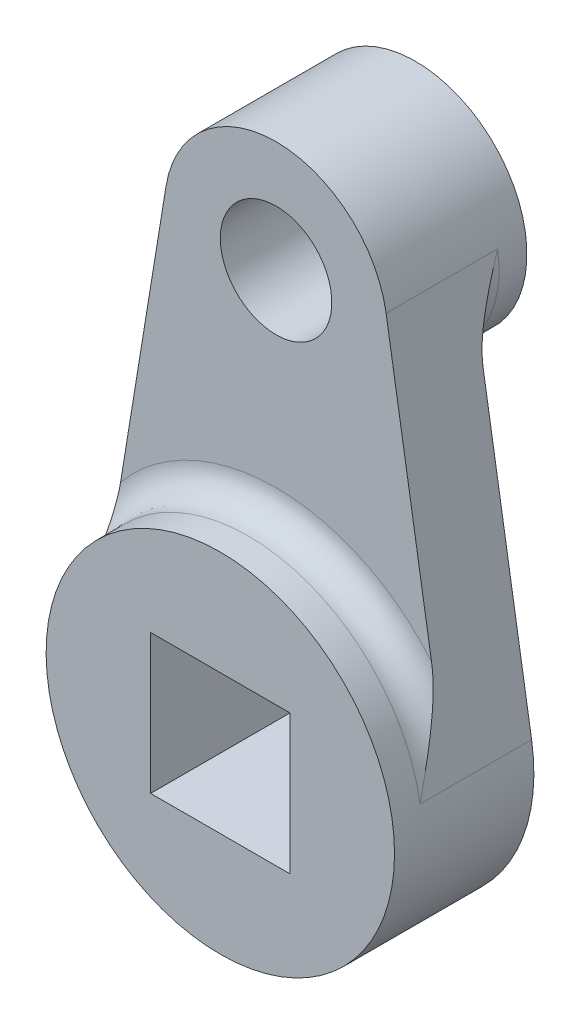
ISO-10303-21;
HEADER;
FILE_DESCRIPTION(('STEP AP214'),'2;1');
FILE_NAME('part.step','',(''),(''),'','','');
FILE_SCHEMA(('AUTOMOTIVE_DESIGN { 1 0 10303 214 1 1 1 1 }'));
ENDSEC;
DATA;
#1=APPLICATION_CONTEXT('core data for automotive mechanical design processes');
#2=APPLICATION_PROTOCOL_DEFINITION('international standard','automotive_design',2000,#1);
#3=PRODUCT_CONTEXT('',#1,'mechanical');
#4=PRODUCT('Part','Part','',(#3));
#5=PRODUCT_RELATED_PRODUCT_CATEGORY('part','',(#4));
#6=PRODUCT_DEFINITION_FORMATION('','',#4);
#7=PRODUCT_DEFINITION_CONTEXT('part definition',#1,'design');
#8=PRODUCT_DEFINITION('design','',#6,#7);
#9=PRODUCT_DEFINITION_SHAPE('','',#8);
#10=(LENGTH_UNIT() NAMED_UNIT(*) SI_UNIT(.MILLI.,.METRE.));
#11=(NAMED_UNIT(*) PLANE_ANGLE_UNIT() SI_UNIT($,.RADIAN.));
#12=(NAMED_UNIT(*) SI_UNIT($,.STERADIAN.) SOLID_ANGLE_UNIT());
#13=UNCERTAINTY_MEASURE_WITH_UNIT(LENGTH_MEASURE(1.E-05),#10,'distance_accuracy_value','');
#14=(GEOMETRIC_REPRESENTATION_CONTEXT(3) GLOBAL_UNCERTAINTY_ASSIGNED_CONTEXT((#13)) GLOBAL_UNIT_ASSIGNED_CONTEXT((#10,
#11,#12)) REPRESENTATION_CONTEXT('',''));
#15=CARTESIAN_POINT('',(0.,0.,0.));
#16=DIRECTION('',(0.,0.,1.));
#17=DIRECTION('',(1.,0.,0.));
#18=AXIS2_PLACEMENT_3D('',#15,#16,#17);
#19=CARTESIAN_POINT('',(0.,711.2,152.4));
#20=DIRECTION('',(0.,0.,1.));
#21=DIRECTION('',(1.,0.,0.));
#22=AXIS2_PLACEMENT_3D('',#19,#20,#21);
#23=PLANE('',#22);
#24=DIRECTION('',(-0.160714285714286,-0.98700097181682,0.));
#25=VECTOR('',#24,1.);
#26=CARTESIAN_POINT('',(-200.558597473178,743.857142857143,152.4));
#27=LINE('',#26,#25);
#28=CARTESIAN_POINT('',(-200.558597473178,743.857142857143,152.4));
#29=VERTEX_POINT('',#28);
#30=CARTESIAN_POINT('',(-283.375307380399,235.251620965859,152.4));
#31=VERTEX_POINT('',#30);
#32=EDGE_CURVE('E177',#29,#31,#27,.T.);
#33=ORIENTED_EDGE('',*,*,#32,.T.);
#34=CARTESIAN_POINT('',(0.,0.,152.4));
#35=DIRECTION('',(0.,0.,1.));
#36=DIRECTION('',(1.,0.,0.));
#37=AXIS2_PLACEMENT_3D('',#34,#35,#36);
#38=CIRCLE('',#37,368.3);
#39=CARTESIAN_POINT('',(283.375307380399,235.251620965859,152.4));
#40=VERTEX_POINT('',#39);
#41=EDGE_CURVE('E67',#31,#40,#38,.F.);
#42=ORIENTED_EDGE('',*,*,#41,.T.);
#43=DIRECTION('',(-0.160714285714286,0.98700097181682,0.));
#44=VECTOR('',#43,1.);
#45=CARTESIAN_POINT('',(200.558597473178,743.857142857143,152.4));
#46=LINE('',#45,#44);
#47=CARTESIAN_POINT('',(200.558597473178,743.857142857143,152.4));
#48=VERTEX_POINT('',#47);
#49=EDGE_CURVE('E180',#40,#48,#46,.T.);
#50=ORIENTED_EDGE('',*,*,#49,.T.);
#51=CARTESIAN_POINT('',(0.,711.2,152.4));
#52=DIRECTION('',(0.,0.,1.));
#53=DIRECTION('',(1.,0.,0.));
#54=AXIS2_PLACEMENT_3D('',#51,#52,#53);
#55=CIRCLE('',#54,203.2);
#56=EDGE_CURVE('E174',#48,#29,#55,.T.);
#57=ORIENTED_EDGE('',*,*,#56,.T.);
#58=EDGE_LOOP('',(#33,#42,#50,#57));
#59=FACE_BOUND('',#58,.T.);
#60=CARTESIAN_POINT('',(0.,711.2,152.4));
#61=DIRECTION('',(0.,0.,1.));
#62=DIRECTION('',(1.,0.,0.));
#63=AXIS2_PLACEMENT_3D('',#60,#61,#62);
#64=CIRCLE('',#63,101.6);
#65=CARTESIAN_POINT('',(-101.6,711.2,152.4));
#66=VERTEX_POINT('',#65);
#67=EDGE_CURVE('E157',#66,#66,#64,.T.);
#68=ORIENTED_EDGE('',*,*,#67,.F.);
#69=EDGE_LOOP('',(#68));
#70=FACE_BOUND('',#69,.T.);
#71=ADVANCED_FACE('F40',(#59,#70),#23,.T.);
#72=CARTESIAN_POINT('',(0.,711.2,0.));
#73=DIRECTION('',(0.,0.,1.));
#74=DIRECTION('',(1.,0.,0.));
#75=AXIS2_PLACEMENT_3D('',#72,#73,#74);
#76=PLANE('',#75);
#77=DIRECTION('',(-0.160714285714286,-0.98700097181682,0.));
#78=VECTOR('',#77,1.);
#79=CARTESIAN_POINT('',(-200.558597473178,743.857142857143,0.));
#80=LINE('',#79,#78);
#81=CARTESIAN_POINT('',(-225.051454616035,593.43819475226,0.));
#82=VERTEX_POINT('',#81);
#83=CARTESIAN_POINT('',(-313.37280855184,51.0267857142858,0.));
#84=VERTEX_POINT('',#83);
#85=EDGE_CURVE('E173',#82,#84,#80,.T.);
#86=ORIENTED_EDGE('',*,*,#85,.F.);
#87=CARTESIAN_POINT('',(0.,711.2,0.));
#88=DIRECTION('',(0.,0.,1.));
#89=DIRECTION('',(1.,0.,0.));
#90=AXIS2_PLACEMENT_3D('',#87,#88,#89);
#91=CIRCLE('',#90,254.);
#92=CARTESIAN_POINT('',(225.051454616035,593.43819475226,0.));
#93=VERTEX_POINT('',#92);
#94=EDGE_CURVE('E200',#82,#93,#91,.T.);
#95=ORIENTED_EDGE('',*,*,#94,.T.);
#96=DIRECTION('',(-0.160714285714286,0.98700097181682,0.));
#97=VECTOR('',#96,1.);
#98=CARTESIAN_POINT('',(200.558597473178,743.857142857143,0.));
#99=LINE('',#98,#97);
#100=CARTESIAN_POINT('',(313.37280855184,51.0267857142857,0.));
#101=VERTEX_POINT('',#100);
#102=EDGE_CURVE('E178',#101,#93,#99,.T.);
#103=ORIENTED_EDGE('',*,*,#102,.F.);
#104=CARTESIAN_POINT('',(0.,0.,0.));
#105=DIRECTION('',(0.,0.,1.));
#106=DIRECTION('',(1.,0.,0.));
#107=AXIS2_PLACEMENT_3D('',#104,#105,#106);
#108=CIRCLE('',#107,317.5);
#109=EDGE_CURVE('E184',#84,#101,#108,.T.);
#110=ORIENTED_EDGE('',*,*,#109,.F.);
#111=EDGE_LOOP('',(#86,#95,#103,#110));
#112=FACE_BOUND('',#111,.T.);
#113=DIRECTION('',(0.,1.,0.));
#114=VECTOR('',#113,1.);
#115=CARTESIAN_POINT('',(127.,-127.,0.));
#116=LINE('',#115,#114);
#117=CARTESIAN_POINT('',(127.,-127.,0.));
#118=VERTEX_POINT('',#117);
#119=CARTESIAN_POINT('',(127.,127.,0.));
#120=VERTEX_POINT('',#119);
#121=EDGE_CURVE('E130',#118,#120,#116,.T.);
#122=ORIENTED_EDGE('',*,*,#121,.T.);
#123=DIRECTION('',(-1.,0.,0.));
#124=VECTOR('',#123,1.);
#125=CARTESIAN_POINT('',(-127.,127.,0.));
#126=LINE('',#125,#124);
#127=CARTESIAN_POINT('',(-127.,127.,0.));
#128=VERTEX_POINT('',#127);
#129=EDGE_CURVE('E161',#120,#128,#126,.T.);
#130=ORIENTED_EDGE('',*,*,#129,.T.);
#131=DIRECTION('',(0.,-1.,0.));
#132=VECTOR('',#131,1.);
#133=CARTESIAN_POINT('',(-127.,-127.,0.));
#134=LINE('',#133,#132);
#135=CARTESIAN_POINT('',(-127.,-127.,0.));
#136=VERTEX_POINT('',#135);
#137=EDGE_CURVE('E164',#128,#136,#134,.T.);
#138=ORIENTED_EDGE('',*,*,#137,.T.);
#139=DIRECTION('',(1.,0.,0.));
#140=VECTOR('',#139,1.);
#141=CARTESIAN_POINT('',(-127.,-127.,0.));
#142=LINE('',#141,#140);
#143=EDGE_CURVE('E135',#136,#118,#142,.T.);
#144=ORIENTED_EDGE('',*,*,#143,.T.);
#145=EDGE_LOOP('',(#122,#130,#138,#144));
#146=FACE_BOUND('',#145,.T.);
#147=ADVANCED_FACE('F255',(#112,#146),#76,.F.);
#148=CARTESIAN_POINT('',(0.,711.2,152.4));
#149=DIRECTION('',(0.,0.,-1.));
#150=DIRECTION('',(-1.,0.,0.));
#151=AXIS2_PLACEMENT_3D('',#148,#149,#150);
#152=CYLINDRICAL_SURFACE('',#151,203.2);
#153=CARTESIAN_POINT('',(0.,711.2,-50.8));
#154=DIRECTION('',(0.,0.,1.));
#155=DIRECTION('',(1.,0.,0.));
#156=AXIS2_PLACEMENT_3D('',#153,#154,#155);
#157=CIRCLE('',#156,203.2);
#158=CARTESIAN_POINT('',(200.558597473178,743.857142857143,-50.7999999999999));
#159=VERTEX_POINT('',#158);
#160=CARTESIAN_POINT('',(-200.558597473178,743.857142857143,-50.8));
#161=VERTEX_POINT('',#160);
#162=EDGE_CURVE('E197',#159,#161,#157,.F.);
#163=ORIENTED_EDGE('',*,*,#162,.T.);
#164=DIRECTION('',(0.,0.,-1.));
#165=VECTOR('',#164,1.);
#166=CARTESIAN_POINT('',(-200.558597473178,743.857142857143,152.4));
#167=LINE('',#166,#165);
#168=EDGE_CURVE('E195',#29,#161,#167,.T.);
#169=ORIENTED_EDGE('',*,*,#168,.F.);
#170=ORIENTED_EDGE('',*,*,#56,.F.);
#171=DIRECTION('',(0.,0.,-1.));
#172=VECTOR('',#171,1.);
#173=CARTESIAN_POINT('',(200.558597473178,743.857142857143,152.4));
#174=LINE('',#173,#172);
#175=EDGE_CURVE('E182',#48,#159,#174,.T.);
#176=ORIENTED_EDGE('',*,*,#175,.T.);
#177=EDGE_LOOP('',(#163,#169,#170,#176));
#178=FACE_BOUND('',#177,.T.);
#179=CARTESIAN_POINT('',(0.,711.2,-101.6));
#180=DIRECTION('',(0.,0.,-1.));
#181=DIRECTION('',(-1.,0.,0.));
#182=AXIS2_PLACEMENT_3D('',#179,#180,#181);
#183=CIRCLE('',#182,203.2);
#184=CARTESIAN_POINT('',(-203.2,711.2,-101.6));
#185=VERTEX_POINT('',#184);
#186=EDGE_CURVE('E143',#185,#185,#183,.T.);
#187=ORIENTED_EDGE('',*,*,#186,.F.);
#188=EDGE_LOOP('',(#187));
#189=FACE_BOUND('',#188,.T.);
#190=ADVANCED_FACE('F226',(#178,#189),#152,.T.);
#191=CARTESIAN_POINT('',(-200.558597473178,743.857142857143,152.4));
#192=DIRECTION('',(0.98700097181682,-0.160714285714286,0.));
#193=DIRECTION('',(0.160714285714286,0.98700097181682,0.));
#194=AXIS2_PLACEMENT_3D('',#191,#192,#193);
#195=PLANE('',#194);
#196=ORIENTED_EDGE('',*,*,#168,.T.);
#197=CARTESIAN_POINT('',(-225.051454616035,593.43819475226,0.));
#198=CARTESIAN_POINT('',(-224.835013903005,594.767430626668,-1.6518655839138E-05));
#199=CARTESIAN_POINT('',(-224.618582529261,596.096609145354,-0.0192793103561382));
#200=CARTESIAN_POINT('',(-224.185902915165,598.753841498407,-0.0944509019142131));
#201=CARTESIAN_POINT('',(-223.969654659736,600.081895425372,-0.150356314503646));
#202=CARTESIAN_POINT('',(-223.53758535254,602.735379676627,-0.296926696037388));
#203=CARTESIAN_POINT('',(-223.321764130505,604.060811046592,-0.387572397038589));
#204=CARTESIAN_POINT('',(-222.890545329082,606.709072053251,-0.601900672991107));
#205=CARTESIAN_POINT('',(-222.675147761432,608.031901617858,-0.725584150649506));
#206=CARTESIAN_POINT('',(-222.031029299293,611.9876516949,-1.14286845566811));
#207=CARTESIAN_POINT('',(-221.603072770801,614.61587797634,-1.48316792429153));
#208=CARTESIAN_POINT('',(-220.749840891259,619.855864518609,-2.27637121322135));
#209=CARTESIAN_POINT('',(-220.324565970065,622.467622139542,-2.72929263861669));
#210=CARTESIAN_POINT('',(-219.482709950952,627.637745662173,-3.73007323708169));
#211=CARTESIAN_POINT('',(-219.066087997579,630.196362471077,-4.27660873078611));
#212=CARTESIAN_POINT('',(-218.23612506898,635.293446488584,-5.45891714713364));
#213=CARTESIAN_POINT('',(-217.822784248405,637.831912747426,-6.09469424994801));
#214=CARTESIAN_POINT('',(-216.999203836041,642.889799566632,-7.44712355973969));
#215=CARTESIAN_POINT('',(-216.588966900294,645.409203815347,-8.16383815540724));
#216=CARTESIAN_POINT('',(-215.771939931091,650.426843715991,-9.66959267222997));
#217=CARTESIAN_POINT('',(-215.365149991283,652.925078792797,-10.4586345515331));
#218=CARTESIAN_POINT('',(-214.337735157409,659.234781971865,-12.5419714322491));
#219=CARTESIAN_POINT('',(-213.719414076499,663.032101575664,-13.8803165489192));
#220=CARTESIAN_POINT('',(-212.490320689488,670.580381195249,-16.684981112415));
#221=CARTESIAN_POINT('',(-211.879549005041,674.331337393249,-18.1513110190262));
#222=CARTESIAN_POINT('',(-210.664837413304,681.791293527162,-21.1896391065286));
#223=CARTESIAN_POINT('',(-210.060897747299,685.500291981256,-22.7616410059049));
#224=CARTESIAN_POINT('',(-208.858980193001,692.881675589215,-25.9908877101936));
#225=CARTESIAN_POINT('',(-208.261002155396,696.554061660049,-27.6481303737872));
#226=CARTESIAN_POINT('',(-207.067580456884,703.883269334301,-31.0358554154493));
#227=CARTESIAN_POINT('',(-206.472156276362,707.539971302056,-32.7666023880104));
#228=CARTESIAN_POINT('',(-205.285085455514,714.830176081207,-36.2774198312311));
#229=CARTESIAN_POINT('',(-204.693438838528,718.463678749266,-38.0574906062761));
#230=CARTESIAN_POINT('',(-202.922476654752,729.33975854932,-43.4458698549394));
#231=CARTESIAN_POINT('',(-201.746997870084,736.558772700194,-47.1027549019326));
#232=CARTESIAN_POINT('',(-200.567237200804,743.804083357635,-50.7731208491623));
#233=CARTESIAN_POINT('',(-200.562917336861,743.83061310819,-50.7865604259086));
#234=CARTESIAN_POINT('',(-200.558597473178,743.857142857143,-50.8));
#235=B_SPLINE_CURVE_WITH_KNOTS('',3,(#197,#198,#199,#200,#201,#202,#203,#204,#205,#206,#207,
#208,#209,#210,#211,#212,#213,#214,#215,#216,#217,#218,#219,#220,#221,#222,#223,#224,#225,#226,
#227,#228,#229,#230,#231,#232,#233,#234),.UNSPECIFIED.,.F.,.F.,(4,2,2,2,2,2,2,2,2,2,2,2,2,2,2,2,
2,2,4),(0.,4.04000313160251,8.07963285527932,12.1170253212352,16.1545281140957,24.2050682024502,
32.2568675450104,40.2030172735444,48.1495393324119,56.1022291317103,64.0551343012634,
76.2725932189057,88.4910515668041,100.709940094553,112.928521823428,125.195601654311,
137.46275720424,161.994166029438,162.084321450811),.UNSPECIFIED.);
#236=EDGE_CURVE('E206',#161,#82,#235,.F.);
#237=ORIENTED_EDGE('',*,*,#236,.T.);
#238=ORIENTED_EDGE('',*,*,#85,.T.);
#239=DIRECTION('',(0.,0.,-1.));
#240=VECTOR('',#239,1.);
#241=CARTESIAN_POINT('',(-313.37280855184,51.0267857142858,152.4));
#242=LINE('',#241,#240);
#243=CARTESIAN_POINT('',(-313.37280855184,51.0267857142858,203.2));
#244=VERTEX_POINT('',#243);
#245=EDGE_CURVE('E192',#244,#84,#242,.T.);
#246=ORIENTED_EDGE('',*,*,#245,.F.);
#247=CARTESIAN_POINT('',(-283.375307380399,235.251620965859,152.4));
#248=CARTESIAN_POINT('',(-283.67033269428,233.439770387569,152.400044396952));
#249=CARTESIAN_POINT('',(-283.965343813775,231.628006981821,152.425555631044));
#250=CARTESIAN_POINT('',(-284.555131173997,228.005922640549,152.524473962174));
#251=CARTESIAN_POINT('',(-284.849907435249,226.195601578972,152.597876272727));
#252=CARTESIAN_POINT('',(-285.43890848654,222.578346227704,152.789485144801));
#253=CARTESIAN_POINT('',(-285.733133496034,220.771410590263,152.907665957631));
#254=CARTESIAN_POINT('',(-286.321074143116,217.16066754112,153.186097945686));
#255=CARTESIAN_POINT('',(-286.614789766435,215.356860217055,153.346350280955));
#256=CARTESIAN_POINT('',(-287.200783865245,211.758071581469,153.705863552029));
#257=CARTESIAN_POINT('',(-287.493064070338,209.963079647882,153.905015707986));
#258=CARTESIAN_POINT('',(-288.076916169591,206.377445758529,154.340252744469));
#259=CARTESIAN_POINT('',(-288.368488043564,204.586803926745,154.576338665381));
#260=CARTESIAN_POINT('',(-289.242105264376,199.221624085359,155.33671241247));
#261=CARTESIAN_POINT('',(-289.822994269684,195.654187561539,155.913079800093));
#262=CARTESIAN_POINT('',(-290.975806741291,188.574374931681,157.18255412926));
#263=CARTESIAN_POINT('',(-291.547763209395,185.061796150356,157.874516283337));
#264=CARTESIAN_POINT('',(-292.688029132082,178.059036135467,159.365062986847));
#265=CARTESIAN_POINT('',(-293.256338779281,174.568853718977,160.163641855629));
#266=CARTESIAN_POINT('',(-294.389740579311,167.608248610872,161.855738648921));
#267=CARTESIAN_POINT('',(-294.95482991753,164.137843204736,162.749329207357));
#268=CARTESIAN_POINT('',(-296.081433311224,157.218989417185,164.619782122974));
#269=CARTESIAN_POINT('',(-296.642947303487,153.770541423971,165.596645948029));
#270=CARTESIAN_POINT('',(-297.890052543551,146.111644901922,167.854248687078));
#271=CARTESIAN_POINT('',(-298.574775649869,141.906527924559,169.153524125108));
#272=CARTESIAN_POINT('',(-299.939474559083,133.5254487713,171.845015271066));
#273=CARTESIAN_POINT('',(-300.619450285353,129.349487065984,173.237232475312));
#274=CARTESIAN_POINT('',(-301.975041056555,121.024344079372,176.098662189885));
#275=CARTESIAN_POINT('',(-302.650656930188,116.875157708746,177.567859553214));
#276=CARTESIAN_POINT('',(-303.998261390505,108.599061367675,180.569019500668));
#277=CARTESIAN_POINT('',(-304.67024999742,104.472151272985,182.100981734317));
#278=CARTESIAN_POINT('',(-306.012710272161,96.2276471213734,185.217487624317));
#279=CARTESIAN_POINT('',(-306.683175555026,92.1100922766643,186.802137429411));
#280=CARTESIAN_POINT('',(-308.021848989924,83.8888443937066,190.007981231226));
#281=CARTESIAN_POINT('',(-308.690057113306,79.7851515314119,191.62917568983));
#282=CARTESIAN_POINT('',(-310.692376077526,67.4882312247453,196.528849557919));
#283=CARTESIAN_POINT('',(-312.024195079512,59.3090787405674,199.843451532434));
#284=CARTESIAN_POINT('',(-313.361597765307,51.0956349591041,203.172097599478));
#285=CARTESIAN_POINT('',(-313.367203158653,51.0612103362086,203.186048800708));
#286=CARTESIAN_POINT('',(-313.37280855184,51.0267857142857,203.2));
#287=B_SPLINE_CURVE_WITH_KNOTS('',3,(#247,#248,#249,#250,#251,#252,#253,#254,#255,#256,#257,
#258,#259,#260,#261,#262,#263,#264,#265,#266,#267,#268,#269,#270,#271,#272,#273,#274,#275,#276,
#277,#278,#279,#280,#281,#282,#283,#284,#285,#286),.UNSPECIFIED.,.F.,.F.,(4,2,2,2,2,2,2,2,2,2,2,
2,2,2,2,2,2,2,2,4),(0.,5.50683449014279,11.0131186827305,16.5162414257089,22.0195159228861,
27.5076158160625,32.9958703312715,43.9734656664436,54.8481721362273,65.722299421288,
76.6048002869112,87.4874930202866,100.848799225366,114.210320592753,127.569222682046,
140.928050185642,154.315651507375,167.70342212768,194.478692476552,194.591386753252),.UNSPECIFIED.);
#288=EDGE_CURVE('E54',#244,#31,#287,.F.);
#289=ORIENTED_EDGE('',*,*,#288,.T.);
#290=ORIENTED_EDGE('',*,*,#32,.F.);
#291=EDGE_LOOP('',(#196,#237,#238,#246,#289,#290));
#292=FACE_BOUND('',#291,.T.);
#293=ADVANCED_FACE('F221',(#292),#195,.F.);
#294=CARTESIAN_POINT('',(0.,0.,152.4));
#295=DIRECTION('',(0.,0.,-1.));
#296=DIRECTION('',(-1.,0.,0.));
#297=AXIS2_PLACEMENT_3D('',#294,#295,#296);
#298=CYLINDRICAL_SURFACE('',#297,317.5);
#299=CARTESIAN_POINT('',(0.,0.,203.2));
#300=DIRECTION('',(0.,0.,1.));
#301=DIRECTION('',(1.,0.,0.));
#302=AXIS2_PLACEMENT_3D('',#299,#300,#301);
#303=CIRCLE('',#302,317.5);
#304=CARTESIAN_POINT('',(313.37280855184,51.0267857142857,203.2));
#305=VERTEX_POINT('',#304);
#306=EDGE_CURVE('E202',#305,#244,#303,.T.);
#307=ORIENTED_EDGE('',*,*,#306,.T.);
#308=ORIENTED_EDGE('',*,*,#245,.T.);
#309=ORIENTED_EDGE('',*,*,#109,.T.);
#310=DIRECTION('',(0.,0.,-1.));
#311=VECTOR('',#310,1.);
#312=CARTESIAN_POINT('',(313.37280855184,51.0267857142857,152.4));
#313=LINE('',#312,#311);
#314=EDGE_CURVE('E189',#305,#101,#313,.T.);
#315=ORIENTED_EDGE('',*,*,#314,.F.);
#316=EDGE_LOOP('',(#307,#308,#309,#315));
#317=FACE_BOUND('',#316,.T.);
#318=CARTESIAN_POINT('',(0.,0.,254.));
#319=DIRECTION('',(0.,0.,1.));
#320=DIRECTION('',(1.,0.,0.));
#321=AXIS2_PLACEMENT_3D('',#318,#319,#320);
#322=CIRCLE('',#321,317.5);
#323=CARTESIAN_POINT('',(317.5,0.,254.));
#324=VERTEX_POINT('',#323);
#325=EDGE_CURVE('E154',#324,#324,#322,.T.);
#326=ORIENTED_EDGE('',*,*,#325,.F.);
#327=EDGE_LOOP('',(#326));
#328=FACE_BOUND('',#327,.T.);
#329=ADVANCED_FACE('F225',(#317,#328),#298,.T.);
#330=CARTESIAN_POINT('',(200.558597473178,743.857142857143,152.4));
#331=DIRECTION('',(-0.98700097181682,-0.160714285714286,0.));
#332=DIRECTION('',(0.160714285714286,-0.98700097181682,0.));
#333=AXIS2_PLACEMENT_3D('',#330,#331,#332);
#334=PLANE('',#333);
#335=ORIENTED_EDGE('',*,*,#102,.T.);
#336=CARTESIAN_POINT('',(225.051454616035,593.43819475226,0.));
#337=CARTESIAN_POINT('',(224.835013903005,594.767430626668,-1.6518655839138E-05));
#338=CARTESIAN_POINT('',(224.618582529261,596.096609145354,-0.0192793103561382));
#339=CARTESIAN_POINT('',(224.185902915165,598.753841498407,-0.0944509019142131));
#340=CARTESIAN_POINT('',(223.969654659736,600.081895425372,-0.150356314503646));
#341=CARTESIAN_POINT('',(223.53758535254,602.735379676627,-0.296926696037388));
#342=CARTESIAN_POINT('',(223.321764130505,604.060811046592,-0.387572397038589));
#343=CARTESIAN_POINT('',(222.890545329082,606.709072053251,-0.601900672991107));
#344=CARTESIAN_POINT('',(222.675147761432,608.031901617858,-0.725584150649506));
#345=CARTESIAN_POINT('',(222.031029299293,611.9876516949,-1.14286845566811));
#346=CARTESIAN_POINT('',(221.603072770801,614.61587797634,-1.48316792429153));
#347=CARTESIAN_POINT('',(220.749840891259,619.855864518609,-2.27637121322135));
#348=CARTESIAN_POINT('',(220.324565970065,622.467622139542,-2.72929263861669));
#349=CARTESIAN_POINT('',(219.482709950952,627.637745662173,-3.73007323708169));
#350=CARTESIAN_POINT('',(219.066087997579,630.196362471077,-4.27660873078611));
#351=CARTESIAN_POINT('',(218.23612506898,635.293446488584,-5.45891714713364));
#352=CARTESIAN_POINT('',(217.822784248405,637.831912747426,-6.09469424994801));
#353=CARTESIAN_POINT('',(216.999203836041,642.889799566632,-7.44712355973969));
#354=CARTESIAN_POINT('',(216.588966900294,645.409203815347,-8.16383815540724));
#355=CARTESIAN_POINT('',(215.771939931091,650.426843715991,-9.66959267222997));
#356=CARTESIAN_POINT('',(215.365149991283,652.925078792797,-10.4586345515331));
#357=CARTESIAN_POINT('',(214.337735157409,659.234781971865,-12.5419714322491));
#358=CARTESIAN_POINT('',(213.719414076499,663.032101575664,-13.8803165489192));
#359=CARTESIAN_POINT('',(212.490320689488,670.580381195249,-16.684981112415));
#360=CARTESIAN_POINT('',(211.879549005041,674.331337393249,-18.1513110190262));
#361=CARTESIAN_POINT('',(210.664837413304,681.791293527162,-21.1896391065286));
#362=CARTESIAN_POINT('',(210.060897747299,685.500291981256,-22.7616410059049));
#363=CARTESIAN_POINT('',(208.858980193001,692.881675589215,-25.9908877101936));
#364=CARTESIAN_POINT('',(208.261002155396,696.554061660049,-27.6481303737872));
#365=CARTESIAN_POINT('',(207.067580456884,703.883269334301,-31.0358554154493));
#366=CARTESIAN_POINT('',(206.472156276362,707.539971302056,-32.7666023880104));
#367=CARTESIAN_POINT('',(205.285085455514,714.830176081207,-36.2774198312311));
#368=CARTESIAN_POINT('',(204.693438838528,718.463678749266,-38.0574906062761));
#369=CARTESIAN_POINT('',(202.922476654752,729.33975854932,-43.4458698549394));
#370=CARTESIAN_POINT('',(201.746997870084,736.558772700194,-47.1027549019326));
#371=CARTESIAN_POINT('',(200.567237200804,743.804083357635,-50.7731208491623));
#372=CARTESIAN_POINT('',(200.562917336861,743.83061310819,-50.7865604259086));
#373=CARTESIAN_POINT('',(200.558597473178,743.857142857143,-50.8));
#374=B_SPLINE_CURVE_WITH_KNOTS('',3,(#336,#337,#338,#339,#340,#341,#342,#343,#344,#345,#346,
#347,#348,#349,#350,#351,#352,#353,#354,#355,#356,#357,#358,#359,#360,#361,#362,#363,#364,#365,
#366,#367,#368,#369,#370,#371,#372,#373),.UNSPECIFIED.,.F.,.F.,(4,2,2,2,2,2,2,2,2,2,2,2,2,2,2,2,
2,2,4),(0.,4.04000313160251,8.07963285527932,12.1170253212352,16.1545281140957,24.2050682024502,
32.2568675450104,40.2030172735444,48.1495393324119,56.1022291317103,64.0551343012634,
76.2725932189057,88.4910515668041,100.709940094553,112.928521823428,125.195601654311,
137.46275720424,161.994166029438,162.084321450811),.UNSPECIFIED.);
#375=EDGE_CURVE('E213',#93,#159,#374,.T.);
#376=ORIENTED_EDGE('',*,*,#375,.T.);
#377=ORIENTED_EDGE('',*,*,#175,.F.);
#378=ORIENTED_EDGE('',*,*,#49,.F.);
#379=CARTESIAN_POINT('',(283.375307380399,235.251620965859,152.4));
#380=CARTESIAN_POINT('',(283.670332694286,233.439770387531,152.400044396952));
#381=CARTESIAN_POINT('',(283.965343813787,231.628006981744,152.425555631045));
#382=CARTESIAN_POINT('',(284.555131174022,228.005922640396,152.524473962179));
#383=CARTESIAN_POINT('',(284.84990743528,226.195601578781,152.597876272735));
#384=CARTESIAN_POINT('',(285.438908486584,222.578346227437,152.789485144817));
#385=CARTESIAN_POINT('',(285.733133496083,220.771410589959,152.907665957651));
#386=CARTESIAN_POINT('',(286.321074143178,217.16066754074,153.186097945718));
#387=CARTESIAN_POINT('',(286.614789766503,215.356860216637,153.346350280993));
#388=CARTESIAN_POINT('',(287.200783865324,211.758071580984,153.70586355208));
#389=CARTESIAN_POINT('',(287.493064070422,209.963079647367,153.905015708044));
#390=CARTESIAN_POINT('',(288.076916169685,206.377445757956,154.340252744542));
#391=CARTESIAN_POINT('',(288.368488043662,204.586803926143,154.576338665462));
#392=CARTESIAN_POINT('',(289.242105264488,199.221624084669,155.336712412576));
#393=CARTESIAN_POINT('',(289.822994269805,195.654187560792,155.913079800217));
#394=CARTESIAN_POINT('',(290.97580674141,188.574374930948,157.1825541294));
#395=CARTESIAN_POINT('',(291.547763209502,185.061796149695,157.874516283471));
#396=CARTESIAN_POINT('',(292.688029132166,178.05903613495,159.365062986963));
#397=CARTESIAN_POINT('',(293.256338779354,174.568853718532,160.163641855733));
#398=CARTESIAN_POINT('',(294.389740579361,167.608248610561,161.855738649));
#399=CARTESIAN_POINT('',(294.954829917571,164.137843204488,162.749329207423));
#400=CARTESIAN_POINT('',(296.081433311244,157.218989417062,164.619782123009));
#401=CARTESIAN_POINT('',(296.642947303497,153.770541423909,165.596645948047));
#402=CARTESIAN_POINT('',(297.89005254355,146.111644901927,167.854248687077));
#403=CARTESIAN_POINT('',(298.574775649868,141.906527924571,169.153524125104));
#404=CARTESIAN_POINT('',(299.939474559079,133.525448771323,171.845015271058));
#405=CARTESIAN_POINT('',(300.619450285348,129.349487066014,173.2372324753));
#406=CARTESIAN_POINT('',(301.975041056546,121.024344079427,176.098662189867));
#407=CARTESIAN_POINT('',(302.650656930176,116.875157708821,177.567859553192));
#408=CARTESIAN_POINT('',(303.998261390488,108.59906136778,180.569019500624));
#409=CARTESIAN_POINT('',(304.670249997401,104.472151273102,182.100981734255));
#410=CARTESIAN_POINT('',(306.012710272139,96.2276471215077,185.217487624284));
#411=CARTESIAN_POINT('',(306.683175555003,92.1100922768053,186.802137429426));
#412=CARTESIAN_POINT('',(308.021848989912,83.8888443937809,190.007981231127));
#413=CARTESIAN_POINT('',(308.690057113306,79.7851515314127,191.629175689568));
#414=CARTESIAN_POINT('',(310.692376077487,67.4882312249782,196.528849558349));
#415=CARTESIAN_POINT('',(312.024195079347,59.3090787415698,199.843451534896));
#416=CARTESIAN_POINT('',(313.361597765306,51.0956349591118,203.172097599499));
#417=CARTESIAN_POINT('',(313.367203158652,51.0612103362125,203.186048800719));
#418=CARTESIAN_POINT('',(313.37280855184,51.0267857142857,203.2));
#419=B_SPLINE_CURVE_WITH_KNOTS('',3,(#379,#380,#381,#382,#383,#384,#385,#386,#387,#388,#389,
#390,#391,#392,#393,#394,#395,#396,#397,#398,#399,#400,#401,#402,#403,#404,#405,#406,#407,#408,
#409,#410,#411,#412,#413,#414,#415,#416,#417,#418),.UNSPECIFIED.,.F.,.F.,(4,2,2,2,2,2,2,2,2,2,2,
2,2,2,2,2,2,2,2,4),(0.,5.50683449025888,11.0131186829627,16.5162414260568,22.0195159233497,
27.5076158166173,32.9958703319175,43.9734656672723,54.8481721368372,65.7222994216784,
76.6048002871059,87.4874930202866,100.848799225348,114.210320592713,127.569222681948,
140.928050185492,154.315651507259,167.703422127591,194.478692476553,194.591386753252),.UNSPECIFIED.);
#420=EDGE_CURVE('E11',#40,#305,#419,.T.);
#421=ORIENTED_EDGE('',*,*,#420,.T.);
#422=ORIENTED_EDGE('',*,*,#314,.T.);
#423=EDGE_LOOP('',(#335,#376,#377,#378,#421,#422));
#424=FACE_BOUND('',#423,.T.);
#425=ADVANCED_FACE('F237',(#424),#334,.F.);
#426=CARTESIAN_POINT('',(127.,-127.,152.4));
#427=DIRECTION('',(-1.,0.,0.));
#428=DIRECTION('',(0.,0.,1.));
#429=AXIS2_PLACEMENT_3D('',#426,#427,#428);
#430=PLANE('',#429);
#431=ORIENTED_EDGE('',*,*,#121,.F.);
#432=DIRECTION('',(0.,0.,-1.));
#433=VECTOR('',#432,1.);
#434=CARTESIAN_POINT('',(127.,-127.,152.4));
#435=LINE('',#434,#433);
#436=CARTESIAN_POINT('',(127.,-127.,254.));
#437=VERTEX_POINT('',#436);
#438=EDGE_CURVE('E122',#437,#118,#435,.T.);
#439=ORIENTED_EDGE('',*,*,#438,.F.);
#440=DIRECTION('',(0.,1.,0.));
#441=VECTOR('',#440,1.);
#442=CARTESIAN_POINT('',(127.,-127.,254.));
#443=LINE('',#442,#441);
#444=CARTESIAN_POINT('',(127.,127.,254.));
#445=VERTEX_POINT('',#444);
#446=EDGE_CURVE('E127',#437,#445,#443,.T.);
#447=ORIENTED_EDGE('',*,*,#446,.T.);
#448=DIRECTION('',(0.,0.,-1.));
#449=VECTOR('',#448,1.);
#450=CARTESIAN_POINT('',(127.,127.,152.4));
#451=LINE('',#450,#449);
#452=EDGE_CURVE('E171',#445,#120,#451,.T.);
#453=ORIENTED_EDGE('',*,*,#452,.T.);
#454=EDGE_LOOP('',(#431,#439,#447,#453));
#455=FACE_BOUND('',#454,.T.);
#456=ADVANCED_FACE('F124',(#455),#430,.T.);
#457=CARTESIAN_POINT('',(-127.,127.,152.4));
#458=DIRECTION('',(0.,-1.,0.));
#459=DIRECTION('',(0.,0.,-1.));
#460=AXIS2_PLACEMENT_3D('',#457,#458,#459);
#461=PLANE('',#460);
#462=ORIENTED_EDGE('',*,*,#129,.F.);
#463=ORIENTED_EDGE('',*,*,#452,.F.);
#464=DIRECTION('',(-1.,0.,0.));
#465=VECTOR('',#464,1.);
#466=CARTESIAN_POINT('',(127.,127.,254.));
#467=LINE('',#466,#465);
#468=CARTESIAN_POINT('',(-127.,127.,254.));
#469=VERTEX_POINT('',#468);
#470=EDGE_CURVE('E147',#445,#469,#467,.T.);
#471=ORIENTED_EDGE('',*,*,#470,.T.);
#472=DIRECTION('',(0.,0.,-1.));
#473=VECTOR('',#472,1.);
#474=CARTESIAN_POINT('',(-127.,127.,152.4));
#475=LINE('',#474,#473);
#476=EDGE_CURVE('E169',#469,#128,#475,.T.);
#477=ORIENTED_EDGE('',*,*,#476,.T.);
#478=EDGE_LOOP('',(#462,#463,#471,#477));
#479=FACE_BOUND('',#478,.T.);
#480=ADVANCED_FACE('F263',(#479),#461,.T.);
#481=CARTESIAN_POINT('',(-127.,-127.,152.4));
#482=DIRECTION('',(1.,0.,0.));
#483=DIRECTION('',(0.,0.,-1.));
#484=AXIS2_PLACEMENT_3D('',#481,#482,#483);
#485=PLANE('',#484);
#486=ORIENTED_EDGE('',*,*,#137,.F.);
#487=ORIENTED_EDGE('',*,*,#476,.F.);
#488=DIRECTION('',(0.,-1.,0.));
#489=VECTOR('',#488,1.);
#490=CARTESIAN_POINT('',(-127.,127.,254.));
#491=LINE('',#490,#489);
#492=CARTESIAN_POINT('',(-127.,-127.,254.));
#493=VERTEX_POINT('',#492);
#494=EDGE_CURVE('E149',#469,#493,#491,.T.);
#495=ORIENTED_EDGE('',*,*,#494,.T.);
#496=DIRECTION('',(0.,0.,-1.));
#497=VECTOR('',#496,1.);
#498=CARTESIAN_POINT('',(-127.,-127.,152.4));
#499=LINE('',#498,#497);
#500=EDGE_CURVE('E134',#493,#136,#499,.T.);
#501=ORIENTED_EDGE('',*,*,#500,.T.);
#502=EDGE_LOOP('',(#486,#487,#495,#501));
#503=FACE_BOUND('',#502,.T.);
#504=ADVANCED_FACE('F261',(#503),#485,.T.);
#505=CARTESIAN_POINT('',(-127.,-127.,152.4));
#506=DIRECTION('',(0.,1.,0.));
#507=DIRECTION('',(0.,0.,1.));
#508=AXIS2_PLACEMENT_3D('',#505,#506,#507);
#509=PLANE('',#508);
#510=ORIENTED_EDGE('',*,*,#143,.F.);
#511=ORIENTED_EDGE('',*,*,#500,.F.);
#512=DIRECTION('',(1.,0.,0.));
#513=VECTOR('',#512,1.);
#514=CARTESIAN_POINT('',(-127.,-127.,254.));
#515=LINE('',#514,#513);
#516=EDGE_CURVE('E138',#493,#437,#515,.T.);
#517=ORIENTED_EDGE('',*,*,#516,.T.);
#518=ORIENTED_EDGE('',*,*,#438,.T.);
#519=EDGE_LOOP('',(#510,#511,#517,#518));
#520=FACE_BOUND('',#519,.T.);
#521=ADVANCED_FACE('F139',(#520),#509,.T.);
#522=CARTESIAN_POINT('',(0.,711.2,152.4));
#523=DIRECTION('',(0.,0.,-1.));
#524=DIRECTION('',(-1.,0.,0.));
#525=AXIS2_PLACEMENT_3D('',#522,#523,#524);
#526=CYLINDRICAL_SURFACE('',#525,101.6);
#527=CARTESIAN_POINT('',(0.,711.2,-101.6));
#528=DIRECTION('',(0.,0.,-1.));
#529=DIRECTION('',(-1.,0.,0.));
#530=AXIS2_PLACEMENT_3D('',#527,#528,#529);
#531=CIRCLE('',#530,101.6);
#532=CARTESIAN_POINT('',(-101.6,711.2,-101.6));
#533=VERTEX_POINT('',#532);
#534=EDGE_CURVE('E410',#533,#533,#531,.T.);
#535=CARTESIAN_POINT('',(-101.6,711.2,152.4));
#536=CARTESIAN_POINT('',(-101.6,711.2,149.754166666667));
#537=CARTESIAN_POINT('',(-101.6,711.2,147.108333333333));
#538=CARTESIAN_POINT('',(-101.6,711.2,141.816666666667));
#539=CARTESIAN_POINT('',(-101.6,711.2,139.170833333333));
#540=CARTESIAN_POINT('',(-101.6,711.2,133.879166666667));
#541=CARTESIAN_POINT('',(-101.6,711.2,131.233333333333));
#542=CARTESIAN_POINT('',(-101.6,711.2,125.941666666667));
#543=CARTESIAN_POINT('',(-101.6,711.2,123.295833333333));
#544=CARTESIAN_POINT('',(-101.6,711.2,118.004166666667));
#545=CARTESIAN_POINT('',(-101.6,711.2,115.358333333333));
#546=CARTESIAN_POINT('',(-101.6,711.2,110.066666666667));
#547=CARTESIAN_POINT('',(-101.6,711.2,107.420833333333));
#548=CARTESIAN_POINT('',(-101.6,711.2,102.129166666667));
#549=CARTESIAN_POINT('',(-101.6,711.2,99.4833333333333));
#550=CARTESIAN_POINT('',(-101.6,711.2,94.1916666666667));
#551=CARTESIAN_POINT('',(-101.6,711.2,91.5458333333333));
#552=CARTESIAN_POINT('',(-101.6,711.2,86.2541666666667));
#553=CARTESIAN_POINT('',(-101.6,711.2,83.6083333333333));
#554=CARTESIAN_POINT('',(-101.6,711.2,78.3166666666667));
#555=CARTESIAN_POINT('',(-101.6,711.2,75.6708333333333));
#556=CARTESIAN_POINT('',(-101.6,711.2,70.3791666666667));
#557=CARTESIAN_POINT('',(-101.6,711.2,67.7333333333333));
#558=CARTESIAN_POINT('',(-101.6,711.2,62.4416666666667));
#559=CARTESIAN_POINT('',(-101.6,711.2,59.7958333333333));
#560=CARTESIAN_POINT('',(-101.6,711.2,54.5041666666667));
#561=CARTESIAN_POINT('',(-101.6,711.2,51.8583333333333));
#562=CARTESIAN_POINT('',(-101.6,711.2,46.5666666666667));
#563=CARTESIAN_POINT('',(-101.6,711.2,43.9208333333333));
#564=CARTESIAN_POINT('',(-101.6,711.2,38.6291666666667));
#565=CARTESIAN_POINT('',(-101.6,711.2,35.9833333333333));
#566=CARTESIAN_POINT('',(-101.6,711.2,30.6916666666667));
#567=CARTESIAN_POINT('',(-101.6,711.2,28.0458333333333));
#568=CARTESIAN_POINT('',(-101.6,711.2,22.7541666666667));
#569=CARTESIAN_POINT('',(-101.6,711.2,20.1083333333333));
#570=CARTESIAN_POINT('',(-101.6,711.2,14.8166666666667));
#571=CARTESIAN_POINT('',(-101.6,711.2,12.1708333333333));
#572=CARTESIAN_POINT('',(-101.6,711.2,6.87916666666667));
#573=CARTESIAN_POINT('',(-101.6,711.2,4.23333333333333));
#574=CARTESIAN_POINT('',(-101.6,711.2,-1.05833333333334));
#575=CARTESIAN_POINT('',(-101.6,711.2,-3.70416666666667));
#576=CARTESIAN_POINT('',(-101.6,711.2,-8.99583333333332));
#577=CARTESIAN_POINT('',(-101.6,711.2,-11.6416666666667));
#578=CARTESIAN_POINT('',(-101.6,711.2,-16.9333333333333));
#579=CARTESIAN_POINT('',(-101.6,711.2,-19.5791666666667));
#580=CARTESIAN_POINT('',(-101.6,711.2,-24.8708333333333));
#581=CARTESIAN_POINT('',(-101.6,711.2,-27.5166666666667));
#582=CARTESIAN_POINT('',(-101.6,711.2,-32.8083333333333));
#583=CARTESIAN_POINT('',(-101.6,711.2,-35.4541666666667));
#584=CARTESIAN_POINT('',(-101.6,711.2,-40.7458333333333));
#585=CARTESIAN_POINT('',(-101.6,711.2,-43.3916666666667));
#586=CARTESIAN_POINT('',(-101.6,711.2,-48.6833333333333));
#587=CARTESIAN_POINT('',(-101.6,711.2,-51.3291666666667));
#588=CARTESIAN_POINT('',(-101.6,711.2,-56.6208333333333));
#589=CARTESIAN_POINT('',(-101.6,711.2,-59.2666666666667));
#590=CARTESIAN_POINT('',(-101.6,711.2,-64.5583333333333));
#591=CARTESIAN_POINT('',(-101.6,711.2,-67.2041666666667));
#592=CARTESIAN_POINT('',(-101.6,711.2,-72.4958333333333));
#593=CARTESIAN_POINT('',(-101.6,711.2,-75.1416666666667));
#594=CARTESIAN_POINT('',(-101.6,711.2,-80.4333333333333));
#595=CARTESIAN_POINT('',(-101.6,711.2,-83.0791666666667));
#596=CARTESIAN_POINT('',(-101.6,711.2,-88.3708333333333));
#597=CARTESIAN_POINT('',(-101.6,711.2,-91.0166666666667));
#598=CARTESIAN_POINT('',(-101.6,711.2,-96.3083333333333));
#599=CARTESIAN_POINT('',(-101.6,711.2,-98.9541666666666));
#600=CARTESIAN_POINT('',(-101.6,711.2,-101.6));
#601=B_SPLINE_CURVE_WITH_KNOTS('',3,(#535,#536,#537,#538,#539,#540,#541,#542,#543,#544,#545,
#546,#547,#548,#549,#550,#551,#552,#553,#554,#555,#556,#557,#558,#559,#560,#561,#562,#563,#564,
#565,#566,#567,#568,#569,#570,#571,#572,#573,#574,#575,#576,#577,#578,#579,#580,#581,#582,#583,
#584,#585,#586,#587,#588,#589,#590,#591,#592,#593,#594,#595,#596,#597,#598,#599,#600),
.UNSPECIFIED.,.F.,.F.,(4,2,2,2,2,2,2,2,2,2,2,2,2,2,2,2,2,2,2,2,2,2,2,2,2,2,2,2,2,2,2,2,4),(0.,
7.93749999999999,15.875,23.8125,31.75,39.6875,47.625,55.5625,63.5,71.4375,79.375,87.3125,95.25,
103.1875,111.125,119.0625,127.,134.9375,142.875,150.8125,158.75,166.6875,174.625,182.5625,190.5,
198.4375,206.375,214.3125,222.25,230.1875,238.125,246.0625,254.),.UNSPECIFIED.);
#602=EDGE_CURVE('BSEAM321',#66,#533,#601,.T.);
#603=ORIENTED_EDGE('',*,*,#67,.T.);
#604=ORIENTED_EDGE('',*,*,#534,.T.);
#605=ORIENTED_EDGE('',*,*,#602,.T.);
#606=ORIENTED_EDGE('',*,*,#602,.F.);
#607=EDGE_LOOP('',(#603,#605,#604,#606));
#608=FACE_BOUND('',#607,.T.);
#609=ADVANCED_FACE('F321',(#608),#526,.F.);
#610=CARTESIAN_POINT('',(0.,0.,254.));
#611=DIRECTION('',(0.,0.,1.));
#612=DIRECTION('',(1.,0.,0.));
#613=AXIS2_PLACEMENT_3D('',#610,#611,#612);
#614=PLANE('',#613);
#615=ORIENTED_EDGE('',*,*,#325,.T.);
#616=EDGE_LOOP('',(#615));
#617=FACE_BOUND('',#616,.T.);
#618=ORIENTED_EDGE('',*,*,#446,.F.);
#619=ORIENTED_EDGE('',*,*,#516,.F.);
#620=ORIENTED_EDGE('',*,*,#494,.F.);
#621=ORIENTED_EDGE('',*,*,#470,.F.);
#622=EDGE_LOOP('',(#618,#619,#620,#621));
#623=FACE_BOUND('',#622,.T.);
#624=ADVANCED_FACE('F145',(#617,#623),#614,.T.);
#625=CARTESIAN_POINT('',(0.,711.2,-101.6));
#626=DIRECTION('',(0.,0.,-1.));
#627=DIRECTION('',(-1.,0.,0.));
#628=AXIS2_PLACEMENT_3D('',#625,#626,#627);
#629=PLANE('',#628);
#630=ORIENTED_EDGE('',*,*,#186,.T.);
#631=EDGE_LOOP('',(#630));
#632=FACE_BOUND('',#631,.T.);
#633=ORIENTED_EDGE('',*,*,#534,.F.);
#634=EDGE_LOOP('',(#633));
#635=FACE_BOUND('',#634,.T.);
#636=ADVANCED_FACE('F307',(#632,#635),#629,.T.);
#637=CARTESIAN_POINT('',(0.,711.2,-50.8));
#638=DIRECTION('',(0.,0.,1.));
#639=DIRECTION('',(1.,0.,0.));
#640=AXIS2_PLACEMENT_3D('',#637,#638,#639);
#641=TOROIDAL_SURFACE('',#640,254.,50.8);
#642=ORIENTED_EDGE('',*,*,#375,.F.);
#643=ORIENTED_EDGE('',*,*,#94,.F.);
#644=ORIENTED_EDGE('',*,*,#236,.F.);
#645=ORIENTED_EDGE('',*,*,#162,.F.);
#646=EDGE_LOOP('',(#642,#643,#644,#645));
#647=FACE_BOUND('',#646,.T.);
#648=ADVANCED_FACE('F218',(#647),#641,.F.);
#649=CARTESIAN_POINT('',(0.,0.,203.2));
#650=DIRECTION('',(0.,0.,1.));
#651=DIRECTION('',(1.,0.,0.));
#652=AXIS2_PLACEMENT_3D('',#649,#650,#651);
#653=TOROIDAL_SURFACE('',#652,368.3,50.8);
#654=ORIENTED_EDGE('',*,*,#420,.F.);
#655=ORIENTED_EDGE('',*,*,#41,.F.);
#656=ORIENTED_EDGE('',*,*,#288,.F.);
#657=ORIENTED_EDGE('',*,*,#306,.F.);
#658=EDGE_LOOP('',(#654,#655,#656,#657));
#659=FACE_BOUND('',#658,.T.);
#660=ADVANCED_FACE('F42',(#659),#653,.F.);
#661=CLOSED_SHELL('',(#71,#147,#190,#293,#329,#425,#456,#480,#504,#521,#609,#624,#636,#648,#660));
#662=MANIFOLD_SOLID_BREP('B2',#661);
#663=ADVANCED_BREP_SHAPE_REPRESENTATION('',(#18,#662),#14);
#664=SHAPE_DEFINITION_REPRESENTATION(#9,#663);
ENDSEC;
END-ISO-10303-21;
